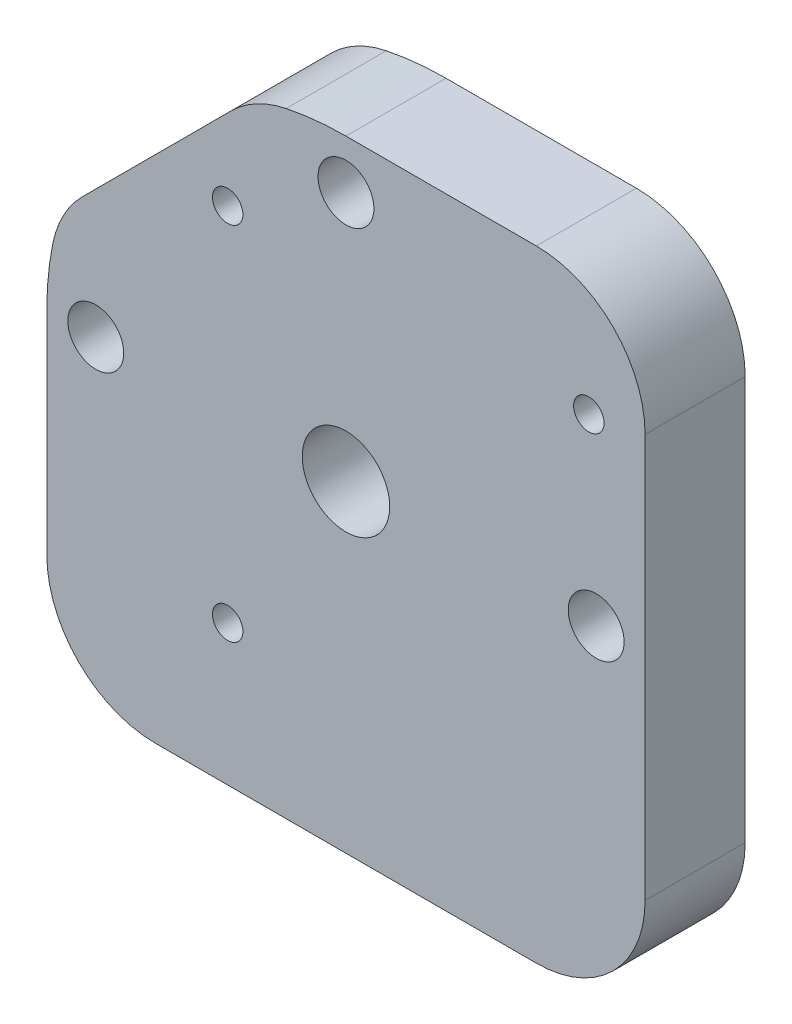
ISO-10303-21;
HEADER;
FILE_DESCRIPTION(('STEP AP214'),'2;1');
FILE_NAME('part.step','',(''),(''),'','','');
FILE_SCHEMA(('AUTOMOTIVE_DESIGN { 1 0 10303 214 1 1 1 1 }'));
ENDSEC;
DATA;
#1=APPLICATION_CONTEXT('core data for automotive mechanical design processes');
#2=APPLICATION_PROTOCOL_DEFINITION('international standard','automotive_design',2000,#1);
#3=PRODUCT_CONTEXT('',#1,'mechanical');
#4=PRODUCT('Part','Part','',(#3));
#5=PRODUCT_RELATED_PRODUCT_CATEGORY('part','',(#4));
#6=PRODUCT_DEFINITION_FORMATION('','',#4);
#7=PRODUCT_DEFINITION_CONTEXT('part definition',#1,'design');
#8=PRODUCT_DEFINITION('design','',#6,#7);
#9=PRODUCT_DEFINITION_SHAPE('','',#8);
#10=(LENGTH_UNIT() NAMED_UNIT(*) SI_UNIT(.MILLI.,.METRE.));
#11=(NAMED_UNIT(*) PLANE_ANGLE_UNIT() SI_UNIT($,.RADIAN.));
#12=(NAMED_UNIT(*) SI_UNIT($,.STERADIAN.) SOLID_ANGLE_UNIT());
#13=UNCERTAINTY_MEASURE_WITH_UNIT(LENGTH_MEASURE(1.E-05),#10,'distance_accuracy_value','');
#14=(GEOMETRIC_REPRESENTATION_CONTEXT(3) GLOBAL_UNCERTAINTY_ASSIGNED_CONTEXT((#13)) GLOBAL_UNIT_ASSIGNED_CONTEXT((#10,
#11,#12)) REPRESENTATION_CONTEXT('',''));
#15=CARTESIAN_POINT('',(0.,0.,0.));
#16=DIRECTION('',(0.,0.,1.));
#17=DIRECTION('',(1.,0.,0.));
#18=AXIS2_PLACEMENT_3D('',#15,#16,#17);
#19=CARTESIAN_POINT('',(0.,0.,5.842));
#20=DIRECTION('',(0.,0.,-1.));
#21=DIRECTION('',(-1.,0.,0.));
#22=AXIS2_PLACEMENT_3D('',#19,#20,#21);
#23=CYLINDRICAL_SURFACE('',#22,17.4625);
#24=CARTESIAN_POINT('',(0.,0.,5.842));
#25=DIRECTION('',(0.,0.,1.));
#26=DIRECTION('',(1.,0.,0.));
#27=AXIS2_PLACEMENT_3D('',#24,#25,#26);
#28=CIRCLE('',#27,17.4625);
#29=CARTESIAN_POINT('',(-17.1106125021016,3.48795728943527,5.842));
#30=VERTEX_POINT('',#29);
#31=CARTESIAN_POINT('',(-17.4625,0.,5.842));
#32=VERTEX_POINT('',#31);
#33=EDGE_CURVE('E147',#30,#32,#28,.T.);
#34=ORIENTED_EDGE('',*,*,#33,.F.);
#35=DIRECTION('',(0.,0.,-1.));
#36=VECTOR('',#35,1.);
#37=CARTESIAN_POINT('',(-17.1106125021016,3.48795728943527,5.842));
#38=LINE('',#37,#36);
#39=CARTESIAN_POINT('',(-17.1106125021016,3.48795728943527,0.));
#40=VERTEX_POINT('',#39);
#41=EDGE_CURVE('E207',#30,#40,#38,.T.);
#42=ORIENTED_EDGE('',*,*,#41,.T.);
#43=CARTESIAN_POINT('',(0.,0.,0.));
#44=DIRECTION('',(0.,0.,1.));
#45=DIRECTION('',(1.,0.,0.));
#46=AXIS2_PLACEMENT_3D('',#43,#44,#45);
#47=CIRCLE('',#46,17.4625);
#48=CARTESIAN_POINT('',(-17.4625,0.,0.));
#49=VERTEX_POINT('',#48);
#50=EDGE_CURVE('E148',#40,#49,#47,.T.);
#51=ORIENTED_EDGE('',*,*,#50,.T.);
#52=DIRECTION('',(0.,0.,1.));
#53=VECTOR('',#52,1.);
#54=CARTESIAN_POINT('',(-17.4625,0.,-50.3431668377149));
#55=LINE('',#54,#53);
#56=EDGE_CURVE('E135',#49,#32,#55,.T.);
#57=ORIENTED_EDGE('',*,*,#56,.T.);
#58=EDGE_LOOP('',(#34,#42,#51,#57));
#59=FACE_BOUND('',#58,.T.);
#60=ADVANCED_FACE('F37',(#59),#23,.T.);
#61=CARTESIAN_POINT('',(0.,17.4625,0.));
#62=VERTEX_POINT('',#61);
#63=CARTESIAN_POINT('',(-3.48795728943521,17.1106125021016,0.));
#64=VERTEX_POINT('',#63);
#65=EDGE_CURVE('E130',#62,#64,#47,.T.);
#66=ORIENTED_EDGE('',*,*,#65,.T.);
#67=DIRECTION('',(0.,0.,-1.));
#68=VECTOR('',#67,1.);
#69=CARTESIAN_POINT('',(-3.48795728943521,17.1106125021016,5.842));
#70=LINE('',#69,#68);
#71=CARTESIAN_POINT('',(-3.48795728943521,17.1106125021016,5.842));
#72=VERTEX_POINT('',#71);
#73=EDGE_CURVE('E11',#64,#72,#70,.F.);
#74=ORIENTED_EDGE('',*,*,#73,.T.);
#75=CARTESIAN_POINT('',(0.,17.4625,5.842));
#76=VERTEX_POINT('',#75);
#77=EDGE_CURVE('E131',#76,#72,#28,.T.);
#78=ORIENTED_EDGE('',*,*,#77,.F.);
#79=DIRECTION('',(0.,0.,1.));
#80=VECTOR('',#79,1.);
#81=CARTESIAN_POINT('',(0.,17.4625,-50.3431668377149));
#82=LINE('',#81,#80);
#83=EDGE_CURVE('E127',#62,#76,#82,.T.);
#84=ORIENTED_EDGE('',*,*,#83,.F.);
#85=EDGE_LOOP('',(#66,#74,#78,#84));
#86=FACE_BOUND('',#85,.T.);
#87=ADVANCED_FACE('F129',(#86),#23,.T.);
#88=CARTESIAN_POINT('',(0.,0.,5.842));
#89=DIRECTION('',(0.,0.,1.));
#90=DIRECTION('',(1.,0.,0.));
#91=AXIS2_PLACEMENT_3D('',#88,#89,#90);
#92=PLANE('',#91);
#93=CARTESIAN_POINT('',(0.,0.,5.842));
#94=DIRECTION('',(0.,0.,1.));
#95=DIRECTION('',(1.,0.,0.));
#96=AXIS2_PLACEMENT_3D('',#93,#94,#95);
#97=CIRCLE('',#96,2.5527);
#98=CARTESIAN_POINT('',(2.5527,0.,5.842));
#99=VERTEX_POINT('',#98);
#100=EDGE_CURVE('E528',#99,#99,#97,.T.);
#101=ORIENTED_EDGE('',*,*,#100,.F.);
#102=EDGE_LOOP('',(#101));
#103=FACE_BOUND('',#102,.T.);
#104=DIRECTION('',(0.707106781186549,0.707106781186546,0.));
#105=VECTOR('',#104,1.);
#106=CARTESIAN_POINT('',(-19.7734727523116,2.31496414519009,5.842));
#107=LINE('',#106,#105);
#108=CARTESIAN_POINT('',(-15.378699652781,6.70973724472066,5.842));
#109=VERTEX_POINT('',#108);
#110=CARTESIAN_POINT('',(-6.70973724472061,15.3786996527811,5.842));
#111=VERTEX_POINT('',#110);
#112=EDGE_CURVE('E221',#109,#111,#107,.T.);
#113=ORIENTED_EDGE('',*,*,#112,.F.);
#114=CARTESIAN_POINT('',(-10.8885715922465,2.21960918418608,5.842));
#115=DIRECTION('',(0.,0.,1.));
#116=DIRECTION('',(1.,0.,0.));
#117=AXIS2_PLACEMENT_3D('',#114,#115,#116);
#118=CIRCLE('',#117,6.35);
#119=EDGE_CURVE('E45',#109,#30,#118,.T.);
#120=ORIENTED_EDGE('',*,*,#119,.T.);
#121=ORIENTED_EDGE('',*,*,#33,.T.);
#122=DIRECTION('',(0.,-1.,0.));
#123=VECTOR('',#122,1.);
#124=CARTESIAN_POINT('',(-17.4625,0.,5.842));
#125=LINE('',#124,#123);
#126=CARTESIAN_POINT('',(-17.4625,-12.446,5.842));
#127=VERTEX_POINT('',#126);
#128=EDGE_CURVE('E163',#32,#127,#125,.T.);
#129=ORIENTED_EDGE('',*,*,#128,.T.);
#130=CARTESIAN_POINT('',(-11.1125,-12.446,5.842));
#131=DIRECTION('',(0.,0.,1.));
#132=DIRECTION('',(1.,0.,0.));
#133=AXIS2_PLACEMENT_3D('',#130,#131,#132);
#134=CIRCLE('',#133,6.35);
#135=CARTESIAN_POINT('',(-11.1125,-18.796,5.842));
#136=VERTEX_POINT('',#135);
#137=EDGE_CURVE('E184',#127,#136,#134,.T.);
#138=ORIENTED_EDGE('',*,*,#137,.T.);
#139=DIRECTION('',(1.,0.,0.));
#140=VECTOR('',#139,1.);
#141=CARTESIAN_POINT('',(-17.4625,-18.796,5.842));
#142=LINE('',#141,#140);
#143=CARTESIAN_POINT('',(11.1125,-18.796,5.842));
#144=VERTEX_POINT('',#143);
#145=EDGE_CURVE('E166',#136,#144,#142,.T.);
#146=ORIENTED_EDGE('',*,*,#145,.T.);
#147=CARTESIAN_POINT('',(11.1125,-12.446,5.842));
#148=DIRECTION('',(0.,0.,1.));
#149=DIRECTION('',(1.,0.,0.));
#150=AXIS2_PLACEMENT_3D('',#147,#148,#149);
#151=CIRCLE('',#150,6.35);
#152=CARTESIAN_POINT('',(17.4625,-12.446,5.842));
#153=VERTEX_POINT('',#152);
#154=EDGE_CURVE('E186',#144,#153,#151,.T.);
#155=ORIENTED_EDGE('',*,*,#154,.T.);
#156=DIRECTION('',(0.,1.,0.));
#157=VECTOR('',#156,1.);
#158=CARTESIAN_POINT('',(17.4625,17.4625,5.842));
#159=LINE('',#158,#157);
#160=CARTESIAN_POINT('',(17.4625,11.1125,5.842));
#161=VERTEX_POINT('',#160);
#162=EDGE_CURVE('E170',#153,#161,#159,.T.);
#163=ORIENTED_EDGE('',*,*,#162,.T.);
#164=CARTESIAN_POINT('',(11.1125,11.1125,5.842));
#165=DIRECTION('',(0.,0.,1.));
#166=DIRECTION('',(1.,0.,0.));
#167=AXIS2_PLACEMENT_3D('',#164,#165,#166);
#168=CIRCLE('',#167,6.35);
#169=CARTESIAN_POINT('',(11.1125,17.4625,5.842));
#170=VERTEX_POINT('',#169);
#171=EDGE_CURVE('E188',#161,#170,#168,.T.);
#172=ORIENTED_EDGE('',*,*,#171,.T.);
#173=DIRECTION('',(-1.,0.,0.));
#174=VECTOR('',#173,1.);
#175=CARTESIAN_POINT('',(0.,17.4625,5.842));
#176=LINE('',#175,#174);
#177=EDGE_CURVE('E136',#170,#76,#176,.T.);
#178=ORIENTED_EDGE('',*,*,#177,.T.);
#179=ORIENTED_EDGE('',*,*,#77,.T.);
#180=CARTESIAN_POINT('',(-2.21960918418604,10.8885715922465,5.842));
#181=DIRECTION('',(0.,0.,1.));
#182=DIRECTION('',(1.,0.,0.));
#183=AXIS2_PLACEMENT_3D('',#180,#181,#182);
#184=CIRCLE('',#183,6.35);
#185=EDGE_CURVE('E52',#72,#111,#184,.T.);
#186=ORIENTED_EDGE('',*,*,#185,.T.);
#187=EDGE_LOOP('',(#113,#120,#121,#129,#138,#146,#155,#163,#172,#178,#179,#186));
#188=FACE_BOUND('',#187,.T.);
#189=CARTESIAN_POINT('',(-6.9051748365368,10.4821939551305,5.842));
#190=DIRECTION('',(0.,0.,1.));
#191=DIRECTION('',(1.,0.,0.));
#192=AXIS2_PLACEMENT_3D('',#189,#190,#191);
#193=CIRCLE('',#192,0.888999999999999);
#194=CARTESIAN_POINT('',(-6.0161748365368,10.4821939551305,5.842));
#195=VERTEX_POINT('',#194);
#196=EDGE_CURVE('E523',#195,#195,#193,.T.);
#197=ORIENTED_EDGE('',*,*,#196,.F.);
#198=EDGE_LOOP('',(#197));
#199=FACE_BOUND('',#198,.T.);
#200=CARTESIAN_POINT('',(-6.90517483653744,-10.5998060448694,5.842));
#201=DIRECTION('',(0.,0.,1.));
#202=DIRECTION('',(1.,0.,0.));
#203=AXIS2_PLACEMENT_3D('',#200,#201,#202);
#204=CIRCLE('',#203,0.888999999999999);
#205=CARTESIAN_POINT('',(-6.01617483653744,-10.5998060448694,5.842));
#206=VERTEX_POINT('',#205);
#207=EDGE_CURVE('E519',#206,#206,#204,.T.);
#208=ORIENTED_EDGE('',*,*,#207,.F.);
#209=EDGE_LOOP('',(#208));
#210=FACE_BOUND('',#209,.T.);
#211=CARTESIAN_POINT('',(14.1768251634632,10.4821939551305,5.842));
#212=DIRECTION('',(0.,0.,1.));
#213=DIRECTION('',(1.,0.,0.));
#214=AXIS2_PLACEMENT_3D('',#211,#212,#213);
#215=CIRCLE('',#214,0.888999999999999);
#216=CARTESIAN_POINT('',(15.0658251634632,10.4821939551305,5.842));
#217=VERTEX_POINT('',#216);
#218=EDGE_CURVE('E515',#217,#217,#215,.T.);
#219=ORIENTED_EDGE('',*,*,#218,.F.);
#220=EDGE_LOOP('',(#219));
#221=FACE_BOUND('',#220,.T.);
#222=CARTESIAN_POINT('',(14.605,0.,5.842));
#223=DIRECTION('',(0.,0.,1.));
#224=DIRECTION('',(1.,0.,0.));
#225=AXIS2_PLACEMENT_3D('',#222,#223,#224);
#226=CIRCLE('',#225,1.63195);
#227=CARTESIAN_POINT('',(16.23695,0.,5.842));
#228=VERTEX_POINT('',#227);
#229=EDGE_CURVE('E511',#228,#228,#226,.T.);
#230=ORIENTED_EDGE('',*,*,#229,.F.);
#231=EDGE_LOOP('',(#230));
#232=FACE_BOUND('',#231,.T.);
#233=CARTESIAN_POINT('',(0.,14.605,5.842));
#234=DIRECTION('',(0.,0.,1.));
#235=DIRECTION('',(1.,0.,0.));
#236=AXIS2_PLACEMENT_3D('',#233,#234,#235);
#237=CIRCLE('',#236,1.63195);
#238=CARTESIAN_POINT('',(1.63195,14.605,5.842));
#239=VERTEX_POINT('',#238);
#240=EDGE_CURVE('E507',#239,#239,#237,.T.);
#241=ORIENTED_EDGE('',*,*,#240,.F.);
#242=EDGE_LOOP('',(#241));
#243=FACE_BOUND('',#242,.T.);
#244=CARTESIAN_POINT('',(-14.605,0.,5.842));
#245=DIRECTION('',(0.,0.,1.));
#246=DIRECTION('',(1.,0.,0.));
#247=AXIS2_PLACEMENT_3D('',#244,#245,#246);
#248=CIRCLE('',#247,1.63195);
#249=CARTESIAN_POINT('',(-12.97305,0.,5.842));
#250=VERTEX_POINT('',#249);
#251=EDGE_CURVE('E502',#250,#250,#248,.T.);
#252=ORIENTED_EDGE('',*,*,#251,.F.);
#253=EDGE_LOOP('',(#252));
#254=FACE_BOUND('',#253,.T.);
#255=ADVANCED_FACE('F219',(#103,#188,#199,#210,#221,#232,#243,#254),#92,.T.);
#256=CARTESIAN_POINT('',(0.,0.,0.));
#257=DIRECTION('',(0.,0.,1.));
#258=DIRECTION('',(1.,0.,0.));
#259=AXIS2_PLACEMENT_3D('',#256,#257,#258);
#260=PLANE('',#259);
#261=CARTESIAN_POINT('',(0.,0.,0.));
#262=DIRECTION('',(0.,0.,1.));
#263=DIRECTION('',(1.,0.,0.));
#264=AXIS2_PLACEMENT_3D('',#261,#262,#263);
#265=CIRCLE('',#264,2.5527);
#266=CARTESIAN_POINT('',(2.5527,0.,0.));
#267=VERTEX_POINT('',#266);
#268=EDGE_CURVE('E479',#267,#267,#265,.T.);
#269=ORIENTED_EDGE('',*,*,#268,.T.);
#270=EDGE_LOOP('',(#269));
#271=FACE_BOUND('',#270,.T.);
#272=CARTESIAN_POINT('',(-6.9051748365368,10.4821939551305,0.));
#273=DIRECTION('',(0.,0.,1.));
#274=DIRECTION('',(1.,0.,0.));
#275=AXIS2_PLACEMENT_3D('',#272,#273,#274);
#276=CIRCLE('',#275,0.888999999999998);
#277=CARTESIAN_POINT('',(-6.0161748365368,10.4821939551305,0.));
#278=VERTEX_POINT('',#277);
#279=EDGE_CURVE('E483',#278,#278,#276,.T.);
#280=ORIENTED_EDGE('',*,*,#279,.T.);
#281=EDGE_LOOP('',(#280));
#282=FACE_BOUND('',#281,.T.);
#283=CARTESIAN_POINT('',(-6.90517483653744,-10.5998060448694,0.));
#284=DIRECTION('',(0.,0.,1.));
#285=DIRECTION('',(1.,0.,0.));
#286=AXIS2_PLACEMENT_3D('',#283,#284,#285);
#287=CIRCLE('',#286,0.888999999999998);
#288=CARTESIAN_POINT('',(-6.01617483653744,-10.5998060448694,0.));
#289=VERTEX_POINT('',#288);
#290=EDGE_CURVE('E487',#289,#289,#287,.T.);
#291=ORIENTED_EDGE('',*,*,#290,.T.);
#292=EDGE_LOOP('',(#291));
#293=FACE_BOUND('',#292,.T.);
#294=CARTESIAN_POINT('',(14.1768251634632,10.4821939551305,0.));
#295=DIRECTION('',(0.,0.,1.));
#296=DIRECTION('',(1.,0.,0.));
#297=AXIS2_PLACEMENT_3D('',#294,#295,#296);
#298=CIRCLE('',#297,0.888999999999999);
#299=CARTESIAN_POINT('',(15.0658251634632,10.4821939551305,0.));
#300=VERTEX_POINT('',#299);
#301=EDGE_CURVE('E491',#300,#300,#298,.T.);
#302=ORIENTED_EDGE('',*,*,#301,.T.);
#303=EDGE_LOOP('',(#302));
#304=FACE_BOUND('',#303,.T.);
#305=CARTESIAN_POINT('',(14.605,0.,0.));
#306=DIRECTION('',(0.,0.,1.));
#307=DIRECTION('',(1.,0.,0.));
#308=AXIS2_PLACEMENT_3D('',#305,#306,#307);
#309=CIRCLE('',#308,1.63195);
#310=CARTESIAN_POINT('',(16.23695,0.,0.));
#311=VERTEX_POINT('',#310);
#312=EDGE_CURVE('E495',#311,#311,#309,.T.);
#313=ORIENTED_EDGE('',*,*,#312,.T.);
#314=EDGE_LOOP('',(#313));
#315=FACE_BOUND('',#314,.T.);
#316=CARTESIAN_POINT('',(0.,14.605,0.));
#317=DIRECTION('',(0.,0.,1.));
#318=DIRECTION('',(1.,0.,0.));
#319=AXIS2_PLACEMENT_3D('',#316,#317,#318);
#320=CIRCLE('',#319,1.63195);
#321=CARTESIAN_POINT('',(1.63195,14.605,0.));
#322=VERTEX_POINT('',#321);
#323=EDGE_CURVE('E499',#322,#322,#320,.T.);
#324=ORIENTED_EDGE('',*,*,#323,.T.);
#325=EDGE_LOOP('',(#324));
#326=FACE_BOUND('',#325,.T.);
#327=CARTESIAN_POINT('',(-14.605,0.,0.));
#328=DIRECTION('',(0.,0.,1.));
#329=DIRECTION('',(1.,0.,0.));
#330=AXIS2_PLACEMENT_3D('',#327,#328,#329);
#331=CIRCLE('',#330,1.63195);
#332=CARTESIAN_POINT('',(-12.97305,0.,0.));
#333=VERTEX_POINT('',#332);
#334=EDGE_CURVE('E167',#333,#333,#331,.T.);
#335=ORIENTED_EDGE('',*,*,#334,.T.);
#336=EDGE_LOOP('',(#335));
#337=FACE_BOUND('',#336,.T.);
#338=ORIENTED_EDGE('',*,*,#50,.F.);
#339=CARTESIAN_POINT('',(-10.8885715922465,2.21960918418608,0.));
#340=DIRECTION('',(0.,0.,1.));
#341=DIRECTION('',(1.,0.,0.));
#342=AXIS2_PLACEMENT_3D('',#339,#340,#341);
#343=CIRCLE('',#342,6.35);
#344=CARTESIAN_POINT('',(-15.378699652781,6.70973724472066,0.));
#345=VERTEX_POINT('',#344);
#346=EDGE_CURVE('E211',#40,#345,#343,.F.);
#347=ORIENTED_EDGE('',*,*,#346,.T.);
#348=DIRECTION('',(0.707106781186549,0.707106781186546,0.));
#349=VECTOR('',#348,1.);
#350=CARTESIAN_POINT('',(-11.0442184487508,11.0442184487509,0.));
#351=LINE('',#350,#349);
#352=CARTESIAN_POINT('',(-6.70973724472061,15.3786996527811,0.));
#353=VERTEX_POINT('',#352);
#354=EDGE_CURVE('E205',#345,#353,#351,.T.);
#355=ORIENTED_EDGE('',*,*,#354,.T.);
#356=CARTESIAN_POINT('',(-2.21960918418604,10.8885715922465,0.));
#357=DIRECTION('',(0.,0.,1.));
#358=DIRECTION('',(1.,0.,0.));
#359=AXIS2_PLACEMENT_3D('',#356,#357,#358);
#360=CIRCLE('',#359,6.35);
#361=EDGE_CURVE('E146',#353,#64,#360,.F.);
#362=ORIENTED_EDGE('',*,*,#361,.T.);
#363=ORIENTED_EDGE('',*,*,#65,.F.);
#364=DIRECTION('',(1.,0.,0.));
#365=VECTOR('',#364,1.);
#366=CARTESIAN_POINT('',(0.,17.4625,0.));
#367=LINE('',#366,#365);
#368=CARTESIAN_POINT('',(11.1125,17.4625,0.));
#369=VERTEX_POINT('',#368);
#370=EDGE_CURVE('E142',#62,#369,#367,.T.);
#371=ORIENTED_EDGE('',*,*,#370,.T.);
#372=CARTESIAN_POINT('',(11.1125,11.1125,0.));
#373=DIRECTION('',(0.,0.,1.));
#374=DIRECTION('',(1.,0.,0.));
#375=AXIS2_PLACEMENT_3D('',#372,#373,#374);
#376=CIRCLE('',#375,6.35);
#377=CARTESIAN_POINT('',(17.4625,11.1125,0.));
#378=VERTEX_POINT('',#377);
#379=EDGE_CURVE('E195',#369,#378,#376,.F.);
#380=ORIENTED_EDGE('',*,*,#379,.T.);
#381=DIRECTION('',(0.,-1.,0.));
#382=VECTOR('',#381,1.);
#383=CARTESIAN_POINT('',(17.4625,17.4625,0.));
#384=LINE('',#383,#382);
#385=CARTESIAN_POINT('',(17.4625,-12.446,0.));
#386=VERTEX_POINT('',#385);
#387=EDGE_CURVE('E154',#378,#386,#384,.T.);
#388=ORIENTED_EDGE('',*,*,#387,.T.);
#389=CARTESIAN_POINT('',(11.1125,-12.446,0.));
#390=DIRECTION('',(0.,0.,1.));
#391=DIRECTION('',(1.,0.,0.));
#392=AXIS2_PLACEMENT_3D('',#389,#390,#391);
#393=CIRCLE('',#392,6.35);
#394=CARTESIAN_POINT('',(11.1125,-18.796,0.));
#395=VERTEX_POINT('',#394);
#396=EDGE_CURVE('E193',#386,#395,#393,.F.);
#397=ORIENTED_EDGE('',*,*,#396,.T.);
#398=DIRECTION('',(-1.,0.,0.));
#399=VECTOR('',#398,1.);
#400=CARTESIAN_POINT('',(-17.4625,-18.796,0.));
#401=LINE('',#400,#399);
#402=CARTESIAN_POINT('',(-11.1125,-18.796,0.));
#403=VERTEX_POINT('',#402);
#404=EDGE_CURVE('E157',#395,#403,#401,.T.);
#405=ORIENTED_EDGE('',*,*,#404,.T.);
#406=CARTESIAN_POINT('',(-11.1125,-12.446,0.));
#407=DIRECTION('',(0.,0.,1.));
#408=DIRECTION('',(1.,0.,0.));
#409=AXIS2_PLACEMENT_3D('',#406,#407,#408);
#410=CIRCLE('',#409,6.35);
#411=CARTESIAN_POINT('',(-17.4625,-12.446,0.));
#412=VERTEX_POINT('',#411);
#413=EDGE_CURVE('E191',#403,#412,#410,.F.);
#414=ORIENTED_EDGE('',*,*,#413,.T.);
#415=DIRECTION('',(0.,1.,0.));
#416=VECTOR('',#415,1.);
#417=CARTESIAN_POINT('',(-17.4625,0.,0.));
#418=LINE('',#417,#416);
#419=EDGE_CURVE('E153',#412,#49,#418,.T.);
#420=ORIENTED_EDGE('',*,*,#419,.T.);
#421=EDGE_LOOP('',(#338,#347,#355,#362,#363,#371,#380,#388,#397,#405,#414,#420));
#422=FACE_BOUND('',#421,.T.);
#423=ADVANCED_FACE('F141',(#271,#282,#293,#304,#315,#326,#337,#422),#260,.F.);
#424=CARTESIAN_POINT('',(17.4625,17.4625,-50.3431668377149));
#425=DIRECTION('',(1.,0.,0.));
#426=DIRECTION('',(0.,0.,-1.));
#427=AXIS2_PLACEMENT_3D('',#424,#425,#426);
#428=PLANE('',#427);
#429=ORIENTED_EDGE('',*,*,#387,.F.);
#430=DIRECTION('',(0.,0.,1.));
#431=VECTOR('',#430,1.);
#432=CARTESIAN_POINT('',(17.4625,11.1125,-50.3431668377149));
#433=LINE('',#432,#431);
#434=EDGE_CURVE('E181',#378,#161,#433,.T.);
#435=ORIENTED_EDGE('',*,*,#434,.T.);
#436=ORIENTED_EDGE('',*,*,#162,.F.);
#437=DIRECTION('',(0.,0.,1.));
#438=VECTOR('',#437,1.);
#439=CARTESIAN_POINT('',(17.4625,-12.446,-50.3431668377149));
#440=LINE('',#439,#438);
#441=EDGE_CURVE('E178',#153,#386,#440,.F.);
#442=ORIENTED_EDGE('',*,*,#441,.T.);
#443=EDGE_LOOP('',(#429,#435,#436,#442));
#444=FACE_BOUND('',#443,.T.);
#445=ADVANCED_FACE('F238',(#444),#428,.T.);
#446=CARTESIAN_POINT('',(-17.4625,0.,-50.3431668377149));
#447=DIRECTION('',(-1.,0.,0.));
#448=DIRECTION('',(0.,-1.,0.));
#449=AXIS2_PLACEMENT_3D('',#446,#447,#448);
#450=PLANE('',#449);
#451=ORIENTED_EDGE('',*,*,#419,.F.);
#452=DIRECTION('',(0.,0.,1.));
#453=VECTOR('',#452,1.);
#454=CARTESIAN_POINT('',(-17.4625,-12.446,-50.3431668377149));
#455=LINE('',#454,#453);
#456=EDGE_CURVE('E202',#412,#127,#455,.T.);
#457=ORIENTED_EDGE('',*,*,#456,.T.);
#458=ORIENTED_EDGE('',*,*,#128,.F.);
#459=ORIENTED_EDGE('',*,*,#56,.F.);
#460=EDGE_LOOP('',(#451,#457,#458,#459));
#461=FACE_BOUND('',#460,.T.);
#462=ADVANCED_FACE('F255',(#461),#450,.T.);
#463=CARTESIAN_POINT('',(0.,17.4625,-50.3431668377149));
#464=DIRECTION('',(0.,1.,0.));
#465=DIRECTION('',(0.,0.,1.));
#466=AXIS2_PLACEMENT_3D('',#463,#464,#465);
#467=PLANE('',#466);
#468=ORIENTED_EDGE('',*,*,#177,.F.);
#469=DIRECTION('',(0.,0.,1.));
#470=VECTOR('',#469,1.);
#471=CARTESIAN_POINT('',(11.1125,17.4625,-50.3431668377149));
#472=LINE('',#471,#470);
#473=EDGE_CURVE('E152',#170,#369,#472,.F.);
#474=ORIENTED_EDGE('',*,*,#473,.T.);
#475=ORIENTED_EDGE('',*,*,#370,.F.);
#476=ORIENTED_EDGE('',*,*,#83,.T.);
#477=EDGE_LOOP('',(#468,#474,#475,#476));
#478=FACE_BOUND('',#477,.T.);
#479=ADVANCED_FACE('F150',(#478),#467,.T.);
#480=CARTESIAN_POINT('',(-17.4625,-18.796,-50.3431668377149));
#481=DIRECTION('',(0.,-1.,0.));
#482=DIRECTION('',(0.,0.,-1.));
#483=AXIS2_PLACEMENT_3D('',#480,#481,#482);
#484=PLANE('',#483);
#485=ORIENTED_EDGE('',*,*,#404,.F.);
#486=DIRECTION('',(0.,0.,1.));
#487=VECTOR('',#486,1.);
#488=CARTESIAN_POINT('',(11.1125,-18.796,-50.3431668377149));
#489=LINE('',#488,#487);
#490=EDGE_CURVE('E199',#395,#144,#489,.T.);
#491=ORIENTED_EDGE('',*,*,#490,.T.);
#492=ORIENTED_EDGE('',*,*,#145,.F.);
#493=DIRECTION('',(0.,0.,1.));
#494=VECTOR('',#493,1.);
#495=CARTESIAN_POINT('',(-11.1125,-18.796,-50.3431668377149));
#496=LINE('',#495,#494);
#497=EDGE_CURVE('E197',#136,#403,#496,.F.);
#498=ORIENTED_EDGE('',*,*,#497,.T.);
#499=EDGE_LOOP('',(#485,#491,#492,#498));
#500=FACE_BOUND('',#499,.T.);
#501=ADVANCED_FACE('F247',(#500),#484,.T.);
#502=CARTESIAN_POINT('',(11.1125,11.1125,-50.3431668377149));
#503=DIRECTION('',(0.,0.,1.));
#504=DIRECTION('',(1.,0.,0.));
#505=AXIS2_PLACEMENT_3D('',#502,#503,#504);
#506=CYLINDRICAL_SURFACE('',#505,6.35);
#507=ORIENTED_EDGE('',*,*,#379,.F.);
#508=ORIENTED_EDGE('',*,*,#473,.F.);
#509=ORIENTED_EDGE('',*,*,#171,.F.);
#510=ORIENTED_EDGE('',*,*,#434,.F.);
#511=EDGE_LOOP('',(#507,#508,#509,#510));
#512=FACE_BOUND('',#511,.T.);
#513=ADVANCED_FACE('F233',(#512),#506,.T.);
#514=CARTESIAN_POINT('',(11.1125,-12.446,-50.3431668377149));
#515=DIRECTION('',(0.,0.,1.));
#516=DIRECTION('',(1.,0.,0.));
#517=AXIS2_PLACEMENT_3D('',#514,#515,#516);
#518=CYLINDRICAL_SURFACE('',#517,6.35);
#519=ORIENTED_EDGE('',*,*,#396,.F.);
#520=ORIENTED_EDGE('',*,*,#441,.F.);
#521=ORIENTED_EDGE('',*,*,#154,.F.);
#522=ORIENTED_EDGE('',*,*,#490,.F.);
#523=EDGE_LOOP('',(#519,#520,#521,#522));
#524=FACE_BOUND('',#523,.T.);
#525=ADVANCED_FACE('F242',(#524),#518,.T.);
#526=CARTESIAN_POINT('',(-11.1125,-12.446,-50.3431668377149));
#527=DIRECTION('',(0.,0.,1.));
#528=DIRECTION('',(1.,0.,0.));
#529=AXIS2_PLACEMENT_3D('',#526,#527,#528);
#530=CYLINDRICAL_SURFACE('',#529,6.35);
#531=ORIENTED_EDGE('',*,*,#413,.F.);
#532=ORIENTED_EDGE('',*,*,#497,.F.);
#533=ORIENTED_EDGE('',*,*,#137,.F.);
#534=ORIENTED_EDGE('',*,*,#456,.F.);
#535=EDGE_LOOP('',(#531,#532,#533,#534));
#536=FACE_BOUND('',#535,.T.);
#537=ADVANCED_FACE('F251',(#536),#530,.T.);
#538=CARTESIAN_POINT('',(-14.605,0.,5.842));
#539=DIRECTION('',(0.,0.,1.));
#540=DIRECTION('',(1.,0.,0.));
#541=AXIS2_PLACEMENT_3D('',#538,#539,#540);
#542=CYLINDRICAL_SURFACE('',#541,1.63195);
#543=ORIENTED_EDGE('',*,*,#334,.F.);
#544=EDGE_LOOP('',(#543));
#545=FACE_BOUND('',#544,.T.);
#546=ORIENTED_EDGE('',*,*,#251,.T.);
#547=EDGE_LOOP('',(#546));
#548=FACE_BOUND('',#547,.T.);
#549=ADVANCED_FACE('F278',(#545,#548),#542,.F.);
#550=CARTESIAN_POINT('',(0.,14.605,5.842));
#551=DIRECTION('',(0.,0.,1.));
#552=DIRECTION('',(1.,0.,0.));
#553=AXIS2_PLACEMENT_3D('',#550,#551,#552);
#554=CYLINDRICAL_SURFACE('',#553,1.63195);
#555=ORIENTED_EDGE('',*,*,#323,.F.);
#556=EDGE_LOOP('',(#555));
#557=FACE_BOUND('',#556,.T.);
#558=ORIENTED_EDGE('',*,*,#240,.T.);
#559=EDGE_LOOP('',(#558));
#560=FACE_BOUND('',#559,.T.);
#561=ADVANCED_FACE('F305',(#557,#560),#554,.F.);
#562=CARTESIAN_POINT('',(14.605,0.,5.842));
#563=DIRECTION('',(0.,0.,1.));
#564=DIRECTION('',(1.,0.,0.));
#565=AXIS2_PLACEMENT_3D('',#562,#563,#564);
#566=CYLINDRICAL_SURFACE('',#565,1.63195);
#567=ORIENTED_EDGE('',*,*,#312,.F.);
#568=EDGE_LOOP('',(#567));
#569=FACE_BOUND('',#568,.T.);
#570=ORIENTED_EDGE('',*,*,#229,.T.);
#571=EDGE_LOOP('',(#570));
#572=FACE_BOUND('',#571,.T.);
#573=ADVANCED_FACE('F301',(#569,#572),#566,.F.);
#574=CARTESIAN_POINT('',(14.1768251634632,10.4821939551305,5.842));
#575=DIRECTION('',(0.,0.,1.));
#576=DIRECTION('',(1.,0.,0.));
#577=AXIS2_PLACEMENT_3D('',#574,#575,#576);
#578=CYLINDRICAL_SURFACE('',#577,0.888999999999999);
#579=ORIENTED_EDGE('',*,*,#301,.F.);
#580=EDGE_LOOP('',(#579));
#581=FACE_BOUND('',#580,.T.);
#582=ORIENTED_EDGE('',*,*,#218,.T.);
#583=EDGE_LOOP('',(#582));
#584=FACE_BOUND('',#583,.T.);
#585=ADVANCED_FACE('F297',(#581,#584),#578,.F.);
#586=CARTESIAN_POINT('',(-6.90517483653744,-10.5998060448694,5.842));
#587=DIRECTION('',(0.,0.,1.));
#588=DIRECTION('',(1.,0.,0.));
#589=AXIS2_PLACEMENT_3D('',#586,#587,#588);
#590=CYLINDRICAL_SURFACE('',#589,0.888999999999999);
#591=ORIENTED_EDGE('',*,*,#290,.F.);
#592=EDGE_LOOP('',(#591));
#593=FACE_BOUND('',#592,.T.);
#594=ORIENTED_EDGE('',*,*,#207,.T.);
#595=EDGE_LOOP('',(#594));
#596=FACE_BOUND('',#595,.T.);
#597=ADVANCED_FACE('F290',(#593,#596),#590,.F.);
#598=CARTESIAN_POINT('',(-6.9051748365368,10.4821939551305,5.842));
#599=DIRECTION('',(0.,0.,1.));
#600=DIRECTION('',(1.,0.,0.));
#601=AXIS2_PLACEMENT_3D('',#598,#599,#600);
#602=CYLINDRICAL_SURFACE('',#601,0.888999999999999);
#603=ORIENTED_EDGE('',*,*,#279,.F.);
#604=EDGE_LOOP('',(#603));
#605=FACE_BOUND('',#604,.T.);
#606=ORIENTED_EDGE('',*,*,#196,.T.);
#607=EDGE_LOOP('',(#606));
#608=FACE_BOUND('',#607,.T.);
#609=ADVANCED_FACE('F285',(#605,#608),#602,.F.);
#610=CARTESIAN_POINT('',(-19.7734727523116,2.31496414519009,-44.958));
#611=DIRECTION('',(0.707106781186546,-0.707106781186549,0.));
#612=DIRECTION('',(0.707106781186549,0.707106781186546,0.));
#613=AXIS2_PLACEMENT_3D('',#610,#611,#612);
#614=PLANE('',#613);
#615=ORIENTED_EDGE('',*,*,#354,.F.);
#616=DIRECTION('',(0.,0.,-1.));
#617=VECTOR('',#616,1.);
#618=CARTESIAN_POINT('',(-15.378699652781,6.70973724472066,-44.958));
#619=LINE('',#618,#617);
#620=EDGE_CURVE('E215',#345,#109,#619,.F.);
#621=ORIENTED_EDGE('',*,*,#620,.T.);
#622=ORIENTED_EDGE('',*,*,#112,.T.);
#623=DIRECTION('',(0.,0.,-1.));
#624=VECTOR('',#623,1.);
#625=CARTESIAN_POINT('',(-6.70973724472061,15.3786996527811,-44.958));
#626=LINE('',#625,#624);
#627=EDGE_CURVE('E213',#111,#353,#626,.T.);
#628=ORIENTED_EDGE('',*,*,#627,.T.);
#629=EDGE_LOOP('',(#615,#621,#622,#628));
#630=FACE_BOUND('',#629,.T.);
#631=ADVANCED_FACE('F231',(#630),#614,.F.);
#632=CARTESIAN_POINT('',(-10.8885715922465,2.21960918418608,5.842));
#633=DIRECTION('',(0.,0.,-1.));
#634=DIRECTION('',(-1.,0.,0.));
#635=AXIS2_PLACEMENT_3D('',#632,#633,#634);
#636=CYLINDRICAL_SURFACE('',#635,6.35);
#637=ORIENTED_EDGE('',*,*,#119,.F.);
#638=ORIENTED_EDGE('',*,*,#620,.F.);
#639=ORIENTED_EDGE('',*,*,#346,.F.);
#640=ORIENTED_EDGE('',*,*,#41,.F.);
#641=EDGE_LOOP('',(#637,#638,#639,#640));
#642=FACE_BOUND('',#641,.T.);
#643=ADVANCED_FACE('F228',(#642),#636,.T.);
#644=CARTESIAN_POINT('',(-2.21960918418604,10.8885715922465,5.842));
#645=DIRECTION('',(0.,0.,-1.));
#646=DIRECTION('',(-1.,0.,0.));
#647=AXIS2_PLACEMENT_3D('',#644,#645,#646);
#648=CYLINDRICAL_SURFACE('',#647,6.35);
#649=ORIENTED_EDGE('',*,*,#361,.F.);
#650=ORIENTED_EDGE('',*,*,#627,.F.);
#651=ORIENTED_EDGE('',*,*,#185,.F.);
#652=ORIENTED_EDGE('',*,*,#73,.F.);
#653=EDGE_LOOP('',(#649,#650,#651,#652));
#654=FACE_BOUND('',#653,.T.);
#655=ADVANCED_FACE('F39',(#654),#648,.T.);
#656=CARTESIAN_POINT('',(0.,0.,5.842));
#657=DIRECTION('',(0.,0.,1.));
#658=DIRECTION('',(1.,0.,0.));
#659=AXIS2_PLACEMENT_3D('',#656,#657,#658);
#660=CYLINDRICAL_SURFACE('',#659,2.5527);
#661=ORIENTED_EDGE('',*,*,#268,.F.);
#662=EDGE_LOOP('',(#661));
#663=FACE_BOUND('',#662,.T.);
#664=ORIENTED_EDGE('',*,*,#100,.T.);
#665=EDGE_LOOP('',(#664));
#666=FACE_BOUND('',#665,.T.);
#667=ADVANCED_FACE('F284',(#663,#666),#660,.F.);
#668=CLOSED_SHELL('',(#60,#87,#255,#423,#445,#462,#479,#501,#513,#525,#537,#549,#561,#573,#585,
#597,#609,#631,#643,#655,#667));
#669=MANIFOLD_SOLID_BREP('B2',#668);
#670=ADVANCED_BREP_SHAPE_REPRESENTATION('',(#18,#669),#14);
#671=SHAPE_DEFINITION_REPRESENTATION(#9,#670);
ENDSEC;
END-ISO-10303-21;
